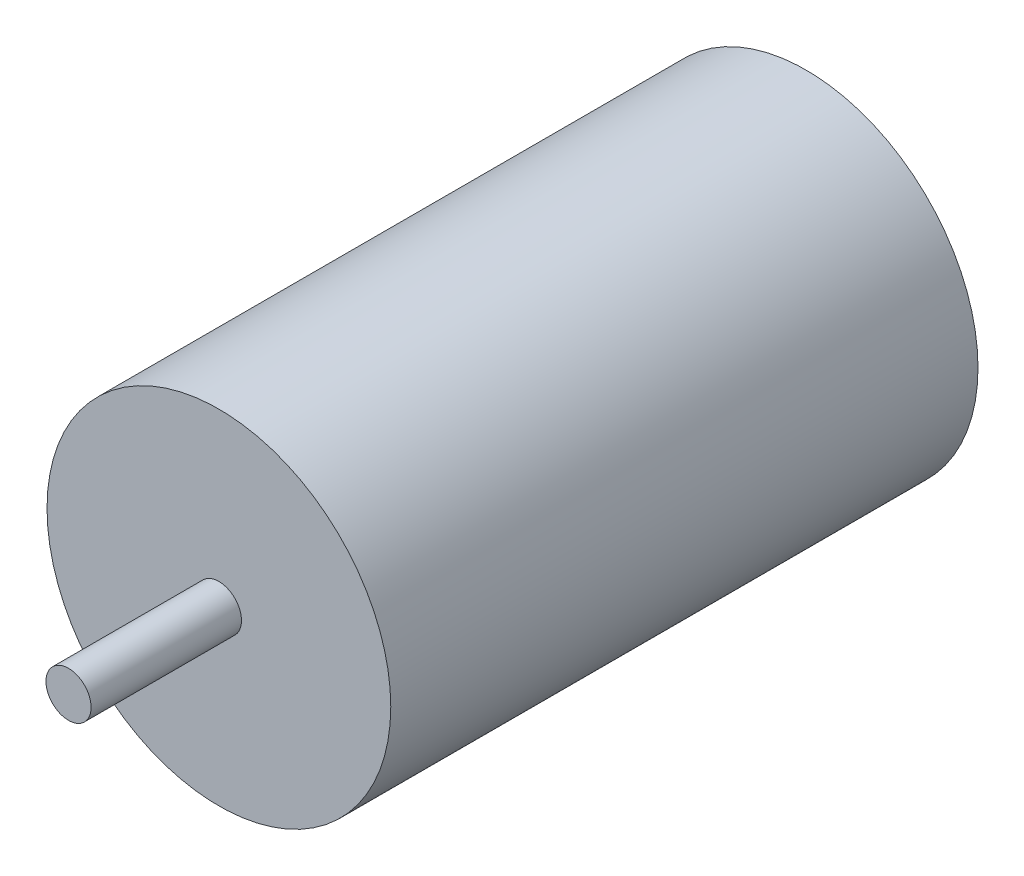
from build123d import *

# Parameters (mm, degrees)
SKETCH1_R           = 30.48
BOSS_EXTRUDE1_DEPTH = 104.14
SKETCH2_R           = 4.0005
BOSS_EXTRUDE2_DEPTH = 26.67


with BuildPart() as part:
    # Sketch1 → Boss-Extrude1 (new body)
    with BuildSketch(Plane.XY):
        Circle(SKETCH1_R)
    extrude(amount=BOSS_EXTRUDE1_DEPTH)

    # Sketch2 → Boss-Extrude2 (add)
    with BuildSketch(Plane.XY.offset(104.14)):
        Circle(SKETCH2_R)
    extrude(amount=BOSS_EXTRUDE2_DEPTH)


solid = part.part
